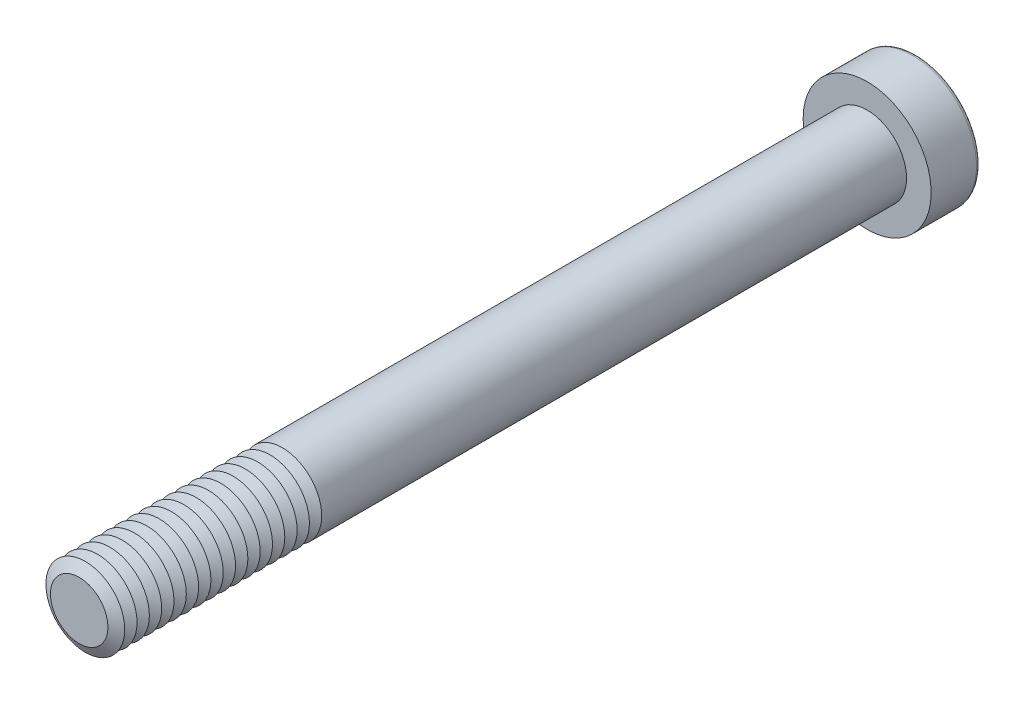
from build123d import *

# Parameters (mm, degrees)
SKETCH1_R           = 4
BOSS_EXTRUDE1_DEPTH = 80
SKETCH2_R           = 6.5
BOSS_EXTRUDE2_DEPTH = 5
CUT_EXTRUDE1_DEPTH  = 3.75
FILLET1_R           = 0.4
LPATTERN1_COUNT     = 17
LPATTERN1_PITCH     = 1.25


with BuildPart() as part:
    # Sketch1 → Boss-Extrude1 (new body)
    with BuildSketch(Plane.XY):
        Circle(SKETCH1_R)
    extrude(amount=BOSS_EXTRUDE1_DEPTH)

    # Sketch2 → Boss-Extrude2 (add)
    with BuildSketch(Plane(origin=(0, 0, 0), x_dir=(-1, 0, 0), z_dir=(0, 0, -1))):
        Circle(SKETCH2_R)
    extrude(amount=BOSS_EXTRUDE2_DEPTH)

    # Sketch3 → Cut-Extrude1 (cut)
    with BuildSketch(Plane(origin=(0, 0, -5), x_dir=(-1, 0, 0), z_dir=(0, 0, -1))):
        Polygon((-1.443375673, 2.5), (-2.886751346, 0), (-1.443375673, -2.5), (1.443375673, -2.5), (2.886751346, 0), (1.443375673, 2.5), align=None)
    extrude(amount=-CUT_EXTRUDE1_DEPTH, mode=Mode.SUBTRACT)

    # Fillet1
    fillet1_edges = [part.edges().sort_by_distance(p)[0] for p in [
        (6.5, 0, -5),
    ]]
    fillet(fillet1_edges, radius=FILLET1_R)

    # Cut-Extrude2 cone 1 section (on through the dimple's axis) → Cut-Extrude2 (revolve, cut)
    with BuildSketch(Plane(origin=(0, 0, -1.25), x_dir=(0, 1, 0), z_dir=(1, 0, 0))):
        Polygon((0, 0), (2.5, 0), (0, 1.443375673), align=None)
    revolve(axis=Axis((0, 0, -1.25), (0, 0, 1)), mode=Mode.SUBTRACT)

    # Cut-Extrude3 cone 1 section (on through the dimple's axis) → Cut-Extrude3 (revolve, cut)
    with BuildSketch(Plane(origin=(0, 0, -5), x_dir=(0, 1, 0), z_dir=(1, 0, 0))):
        Polygon((0, 0), (2.886751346, 0), (0, 0.773502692), align=None)
    revolve(axis=Axis((0, 0, -5), (0, 0, 1)), mode=Mode.SUBTRACT)

    # Sketch7 → Cut-Revolve1 (revolve, cut)
    with BuildSketch(Plane(origin=(0, 0, 0), x_dir=(0, 0, -1), z_dir=(1, 0, 0)), mode=Mode.PRIVATE) as cut_revolve1_sk:
        Polygon((-80, 2.917468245), (-79.375, 4), (-80.625, 4), align=None)
    cut_revolve1 = revolve(cut_revolve1_sk.sketch.rotate(Axis((0, 0, 80), (0, 0, -1)), 90), axis=Axis((0, 0, 80), (0, 0, -1)), mode=Mode.SUBTRACT)

    # LPattern1: Cut-Revolve1 ×17
    with Locations(*[(0, 0, -i * LPATTERN1_PITCH) for i in range(1, LPATTERN1_COUNT)]):
        add(cut_revolve1, mode=Mode.SUBTRACT)


solid = part.part
